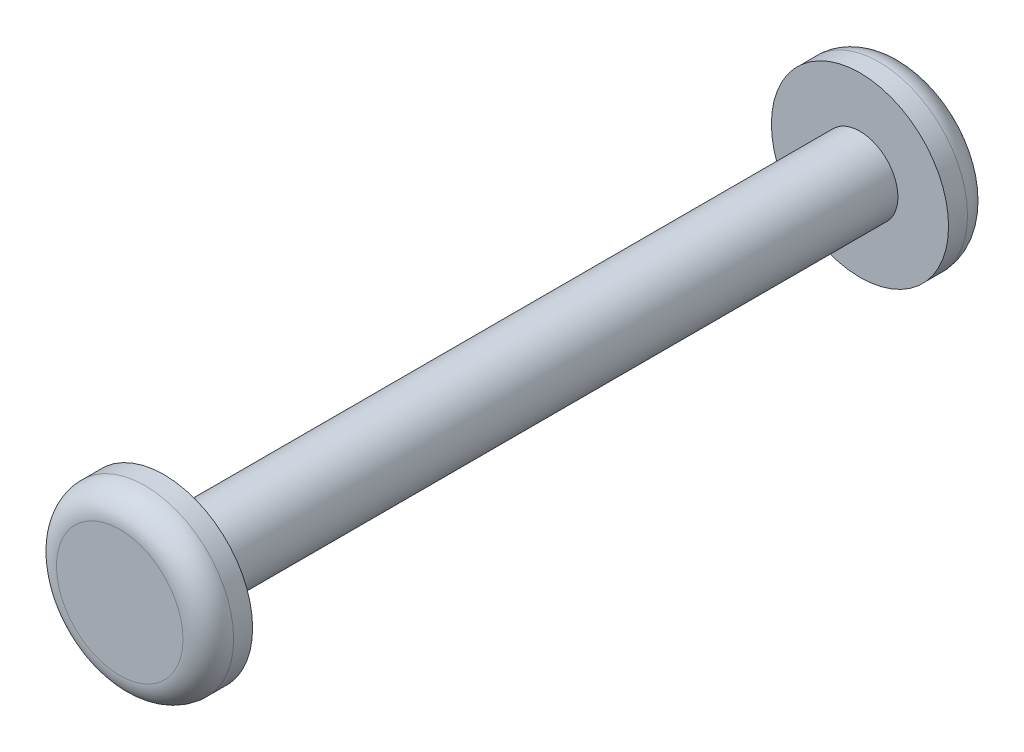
ISO-10303-21;
HEADER;
FILE_DESCRIPTION(('STEP AP214'),'2;1');
FILE_NAME('part.step','',(''),(''),'','','');
FILE_SCHEMA(('AUTOMOTIVE_DESIGN { 1 0 10303 214 1 1 1 1 }'));
ENDSEC;
DATA;
#1=APPLICATION_CONTEXT('core data for automotive mechanical design processes');
#2=APPLICATION_PROTOCOL_DEFINITION('international standard','automotive_design',2000,#1);
#3=PRODUCT_CONTEXT('',#1,'mechanical');
#4=PRODUCT('Part','Part','',(#3));
#5=PRODUCT_RELATED_PRODUCT_CATEGORY('part','',(#4));
#6=PRODUCT_DEFINITION_FORMATION('','',#4);
#7=PRODUCT_DEFINITION_CONTEXT('part definition',#1,'design');
#8=PRODUCT_DEFINITION('design','',#6,#7);
#9=PRODUCT_DEFINITION_SHAPE('','',#8);
#10=(LENGTH_UNIT() NAMED_UNIT(*) SI_UNIT(.MILLI.,.METRE.));
#11=(NAMED_UNIT(*) PLANE_ANGLE_UNIT() SI_UNIT($,.RADIAN.));
#12=(NAMED_UNIT(*) SI_UNIT($,.STERADIAN.) SOLID_ANGLE_UNIT());
#13=UNCERTAINTY_MEASURE_WITH_UNIT(LENGTH_MEASURE(1.E-05),#10,'distance_accuracy_value','');
#14=(GEOMETRIC_REPRESENTATION_CONTEXT(3) GLOBAL_UNCERTAINTY_ASSIGNED_CONTEXT((#13)) GLOBAL_UNIT_ASSIGNED_CONTEXT((#10,
#11,#12)) REPRESENTATION_CONTEXT('',''));
#15=CARTESIAN_POINT('',(0.,0.,0.));
#16=DIRECTION('',(0.,0.,1.));
#17=DIRECTION('',(1.,0.,0.));
#18=AXIS2_PLACEMENT_3D('',#15,#16,#17);
#19=CARTESIAN_POINT('',(0.,0.,62.));
#20=DIRECTION('',(0.,0.,1.));
#21=DIRECTION('',(1.,0.,0.));
#22=AXIS2_PLACEMENT_3D('',#19,#20,#21);
#23=PLANE('',#22);
#24=CARTESIAN_POINT('',(0.,0.,62.));
#25=DIRECTION('',(0.,0.,1.));
#26=DIRECTION('',(1.,0.,0.));
#27=AXIS2_PLACEMENT_3D('',#24,#25,#26);
#28=CIRCLE('',#27,5.);
#29=CARTESIAN_POINT('',(5.,0.,62.));
#30=VERTEX_POINT('',#29);
#31=EDGE_CURVE('E8',#30,#30,#28,.T.);
#32=ORIENTED_EDGE('',*,*,#31,.T.);
#33=EDGE_LOOP('',(#32));
#34=FACE_BOUND('',#33,.T.);
#35=ADVANCED_FACE('F12',(#34),#23,.T.);
#36=CARTESIAN_POINT('',(0.,0.,60.));
#37=DIRECTION('',(0.,0.,1.));
#38=DIRECTION('',(1.,0.,0.));
#39=AXIS2_PLACEMENT_3D('',#36,#37,#38);
#40=TOROIDAL_SURFACE('',#39,4.99999999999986,2.00000000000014);
#41=CARTESIAN_POINT('',(0.,0.,60.));
#42=DIRECTION('',(0.,0.,1.));
#43=DIRECTION('',(1.,0.,0.));
#44=AXIS2_PLACEMENT_3D('',#41,#42,#43);
#45=CIRCLE('',#44,7.);
#46=CARTESIAN_POINT('',(7.,0.,60.));
#47=VERTEX_POINT('',#46);
#48=EDGE_CURVE('E18',#47,#47,#45,.T.);
#49=ORIENTED_EDGE('',*,*,#48,.T.);
#50=EDGE_LOOP('',(#49));
#51=FACE_BOUND('',#50,.T.);
#52=ORIENTED_EDGE('',*,*,#31,.F.);
#53=EDGE_LOOP('',(#52));
#54=FACE_BOUND('',#53,.T.);
#55=ADVANCED_FACE('F58',(#51,#54),#40,.T.);
#56=CARTESIAN_POINT('',(0.,0.,0.));
#57=DIRECTION('',(0.,0.,1.));
#58=DIRECTION('',(1.,0.,0.));
#59=AXIS2_PLACEMENT_3D('',#56,#57,#58);
#60=CYLINDRICAL_SURFACE('',#59,7.);
#61=CARTESIAN_POINT('',(0.,0.,58.5));
#62=DIRECTION('',(0.,0.,1.));
#63=DIRECTION('',(1.,0.,0.));
#64=AXIS2_PLACEMENT_3D('',#61,#62,#63);
#65=CIRCLE('',#64,7.);
#66=CARTESIAN_POINT('',(7.,0.,58.5));
#67=VERTEX_POINT('',#66);
#68=EDGE_CURVE('E22',#67,#67,#65,.T.);
#69=ORIENTED_EDGE('',*,*,#68,.T.);
#70=EDGE_LOOP('',(#69));
#71=FACE_BOUND('',#70,.T.);
#72=ORIENTED_EDGE('',*,*,#48,.F.);
#73=EDGE_LOOP('',(#72));
#74=FACE_BOUND('',#73,.T.);
#75=ADVANCED_FACE('F63',(#71,#74),#60,.T.);
#76=CARTESIAN_POINT('',(0.,7.,58.5));
#77=DIRECTION('',(0.,0.,-1.));
#78=DIRECTION('',(-1.,0.,0.));
#79=AXIS2_PLACEMENT_3D('',#76,#77,#78);
#80=PLANE('',#79);
#81=CARTESIAN_POINT('',(0.,0.,58.5));
#82=DIRECTION('',(0.,0.,1.));
#83=DIRECTION('',(1.,0.,0.));
#84=AXIS2_PLACEMENT_3D('',#81,#82,#83);
#85=CIRCLE('',#84,3.);
#86=CARTESIAN_POINT('',(3.,0.,58.5));
#87=VERTEX_POINT('',#86);
#88=EDGE_CURVE('E26',#87,#87,#85,.T.);
#89=ORIENTED_EDGE('',*,*,#88,.T.);
#90=EDGE_LOOP('',(#89));
#91=FACE_BOUND('',#90,.T.);
#92=ORIENTED_EDGE('',*,*,#68,.F.);
#93=EDGE_LOOP('',(#92));
#94=FACE_BOUND('',#93,.T.);
#95=ADVANCED_FACE('F68',(#91,#94),#80,.T.);
#96=CARTESIAN_POINT('',(0.,0.,0.));
#97=DIRECTION('',(0.,0.,1.));
#98=DIRECTION('',(1.,0.,0.));
#99=AXIS2_PLACEMENT_3D('',#96,#97,#98);
#100=CYLINDRICAL_SURFACE('',#99,3.);
#101=CARTESIAN_POINT('',(0.,0.,3.5));
#102=DIRECTION('',(0.,0.,1.));
#103=DIRECTION('',(1.,0.,0.));
#104=AXIS2_PLACEMENT_3D('',#101,#102,#103);
#105=CIRCLE('',#104,3.);
#106=CARTESIAN_POINT('',(3.,0.,3.5));
#107=VERTEX_POINT('',#106);
#108=EDGE_CURVE('E31',#107,#107,#105,.T.);
#109=ORIENTED_EDGE('',*,*,#108,.T.);
#110=EDGE_LOOP('',(#109));
#111=FACE_BOUND('',#110,.T.);
#112=ORIENTED_EDGE('',*,*,#88,.F.);
#113=EDGE_LOOP('',(#112));
#114=FACE_BOUND('',#113,.T.);
#115=ADVANCED_FACE('F75',(#111,#114),#100,.T.);
#116=CARTESIAN_POINT('',(0.,3.,3.5));
#117=DIRECTION('',(0.,0.,1.));
#118=DIRECTION('',(1.,0.,0.));
#119=AXIS2_PLACEMENT_3D('',#116,#117,#118);
#120=PLANE('',#119);
#121=CARTESIAN_POINT('',(0.,0.,3.5));
#122=DIRECTION('',(0.,0.,1.));
#123=DIRECTION('',(1.,0.,0.));
#124=AXIS2_PLACEMENT_3D('',#121,#122,#123);
#125=CIRCLE('',#124,7.);
#126=CARTESIAN_POINT('',(7.,0.,3.5));
#127=VERTEX_POINT('',#126);
#128=EDGE_CURVE('E34',#127,#127,#125,.T.);
#129=ORIENTED_EDGE('',*,*,#128,.T.);
#130=EDGE_LOOP('',(#129));
#131=FACE_BOUND('',#130,.T.);
#132=ORIENTED_EDGE('',*,*,#108,.F.);
#133=EDGE_LOOP('',(#132));
#134=FACE_BOUND('',#133,.T.);
#135=ADVANCED_FACE('F79',(#131,#134),#120,.T.);
#136=CARTESIAN_POINT('',(0.,0.,0.));
#137=DIRECTION('',(0.,0.,1.));
#138=DIRECTION('',(1.,0.,0.));
#139=AXIS2_PLACEMENT_3D('',#136,#137,#138);
#140=CYLINDRICAL_SURFACE('',#139,7.);
#141=CARTESIAN_POINT('',(0.,0.,2.));
#142=DIRECTION('',(0.,0.,1.));
#143=DIRECTION('',(1.,0.,0.));
#144=AXIS2_PLACEMENT_3D('',#141,#142,#143);
#145=CIRCLE('',#144,7.);
#146=CARTESIAN_POINT('',(7.,0.,2.));
#147=VERTEX_POINT('',#146);
#148=EDGE_CURVE('E37',#147,#147,#145,.T.);
#149=ORIENTED_EDGE('',*,*,#148,.T.);
#150=EDGE_LOOP('',(#149));
#151=FACE_BOUND('',#150,.T.);
#152=ORIENTED_EDGE('',*,*,#128,.F.);
#153=EDGE_LOOP('',(#152));
#154=FACE_BOUND('',#153,.T.);
#155=ADVANCED_FACE('F55',(#151,#154),#140,.T.);
#156=CARTESIAN_POINT('',(0.,0.,2.));
#157=DIRECTION('',(0.,0.,1.));
#158=DIRECTION('',(1.,0.,0.));
#159=AXIS2_PLACEMENT_3D('',#156,#157,#158);
#160=TOROIDAL_SURFACE('',#159,4.99999999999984,2.00000000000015);
#161=CARTESIAN_POINT('',(0.,0.,0.));
#162=DIRECTION('',(0.,0.,1.));
#163=DIRECTION('',(1.,0.,0.));
#164=AXIS2_PLACEMENT_3D('',#161,#162,#163);
#165=CIRCLE('',#164,5.);
#166=CARTESIAN_POINT('',(5.,0.,0.));
#167=VERTEX_POINT('',#166);
#168=EDGE_CURVE('E40',#167,#167,#165,.T.);
#169=ORIENTED_EDGE('',*,*,#168,.T.);
#170=EDGE_LOOP('',(#169));
#171=FACE_BOUND('',#170,.T.);
#172=ORIENTED_EDGE('',*,*,#148,.F.);
#173=EDGE_LOOP('',(#172));
#174=FACE_BOUND('',#173,.T.);
#175=ADVANCED_FACE('F44',(#171,#174),#160,.T.);
#176=CARTESIAN_POINT('',(0.,5.,0.));
#177=DIRECTION('',(0.,0.,-1.));
#178=DIRECTION('',(-1.,0.,0.));
#179=AXIS2_PLACEMENT_3D('',#176,#177,#178);
#180=PLANE('',#179);
#181=ORIENTED_EDGE('',*,*,#168,.F.);
#182=EDGE_LOOP('',(#181));
#183=FACE_BOUND('',#182,.T.);
#184=ADVANCED_FACE('F47',(#183),#180,.T.);
#185=CLOSED_SHELL('',(#35,#55,#75,#95,#115,#135,#155,#175,#184));
#186=MANIFOLD_SOLID_BREP('B1',#185);
#187=ADVANCED_BREP_SHAPE_REPRESENTATION('',(#18,#186),#14);
#188=SHAPE_DEFINITION_REPRESENTATION(#9,#187);
ENDSEC;
END-ISO-10303-21;
